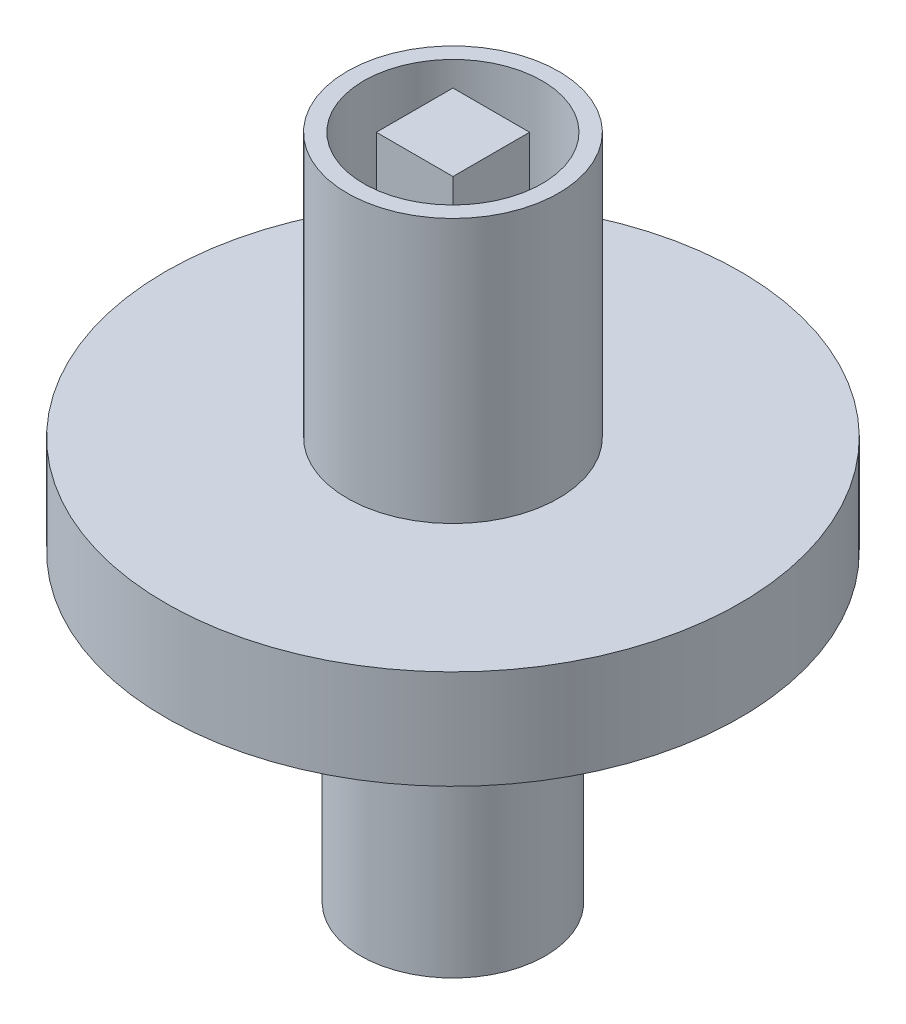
ISO-10303-21;
HEADER;
FILE_DESCRIPTION(('STEP AP214'),'2;1');
FILE_NAME('part.step','',(''),(''),'','','');
FILE_SCHEMA(('AUTOMOTIVE_DESIGN { 1 0 10303 214 1 1 1 1 }'));
ENDSEC;
DATA;
#1=APPLICATION_CONTEXT('core data for automotive mechanical design processes');
#2=APPLICATION_PROTOCOL_DEFINITION('international standard','automotive_design',2000,#1);
#3=PRODUCT_CONTEXT('',#1,'mechanical');
#4=PRODUCT('Part','Part','',(#3));
#5=PRODUCT_RELATED_PRODUCT_CATEGORY('part','',(#4));
#6=PRODUCT_DEFINITION_FORMATION('','',#4);
#7=PRODUCT_DEFINITION_CONTEXT('part definition',#1,'design');
#8=PRODUCT_DEFINITION('design','',#6,#7);
#9=PRODUCT_DEFINITION_SHAPE('','',#8);
#10=(LENGTH_UNIT() NAMED_UNIT(*) SI_UNIT(.MILLI.,.METRE.));
#11=(NAMED_UNIT(*) PLANE_ANGLE_UNIT() SI_UNIT($,.RADIAN.));
#12=(NAMED_UNIT(*) SI_UNIT($,.STERADIAN.) SOLID_ANGLE_UNIT());
#13=UNCERTAINTY_MEASURE_WITH_UNIT(LENGTH_MEASURE(1.E-05),#10,'distance_accuracy_value','');
#14=(GEOMETRIC_REPRESENTATION_CONTEXT(3) GLOBAL_UNCERTAINTY_ASSIGNED_CONTEXT((#13)) GLOBAL_UNIT_ASSIGNED_CONTEXT((#10,
#11,#12)) REPRESENTATION_CONTEXT('',''));
#15=CARTESIAN_POINT('',(0.,0.,0.));
#16=DIRECTION('',(0.,0.,1.));
#17=DIRECTION('',(1.,0.,0.));
#18=AXIS2_PLACEMENT_3D('',#15,#16,#17);
#19=CARTESIAN_POINT('',(0.,-8.,0.));
#20=DIRECTION('',(0.,-1.,0.));
#21=DIRECTION('',(1.,0.,0.));
#22=AXIS2_PLACEMENT_3D('',#19,#20,#21);
#23=CYLINDRICAL_SURFACE('',#22,3.5);
#24=CARTESIAN_POINT('',(0.,-8.,0.));
#25=DIRECTION('',(0.,-1.,0.));
#26=DIRECTION('',(1.,0.,0.));
#27=AXIS2_PLACEMENT_3D('',#24,#25,#26);
#28=CIRCLE('',#27,3.5);
#29=CARTESIAN_POINT('',(-1.49999999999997,-8.00000000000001,3.16227766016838));
#30=VERTEX_POINT('',#29);
#31=CARTESIAN_POINT('',(-3.16227766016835,-8.00000000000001,1.5));
#32=VERTEX_POINT('',#31);
#33=EDGE_CURVE('E199',#30,#32,#28,.T.);
#34=ORIENTED_EDGE('',*,*,#33,.F.);
#35=DIRECTION('',(0.,-1.,0.));
#36=VECTOR('',#35,1.);
#37=CARTESIAN_POINT('',(-1.49999999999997,-8.00000000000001,3.16227766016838));
#38=LINE('',#37,#36);
#39=CARTESIAN_POINT('',(-1.49999999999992,-23.,3.16227766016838));
#40=VERTEX_POINT('',#39);
#41=EDGE_CURVE('E338',#30,#40,#38,.T.);
#42=ORIENTED_EDGE('',*,*,#41,.T.);
#43=CARTESIAN_POINT('',(0.,-23.,0.));
#44=DIRECTION('',(0.,-1.,0.));
#45=DIRECTION('',(1.,0.,0.));
#46=AXIS2_PLACEMENT_3D('',#43,#44,#45);
#47=CIRCLE('',#46,3.5);
#48=CARTESIAN_POINT('',(-3.1622776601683,-23.,1.5));
#49=VERTEX_POINT('',#48);
#50=EDGE_CURVE('E352',#40,#49,#47,.T.);
#51=ORIENTED_EDGE('',*,*,#50,.T.);
#52=DIRECTION('',(0.,-1.,0.));
#53=VECTOR('',#52,1.);
#54=CARTESIAN_POINT('',(-3.16227766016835,-8.00000000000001,1.5));
#55=LINE('',#54,#53);
#56=EDGE_CURVE('E291',#49,#32,#55,.F.);
#57=ORIENTED_EDGE('',*,*,#56,.T.);
#58=EDGE_LOOP('',(#34,#42,#51,#57));
#59=FACE_BOUND('',#58,.T.);
#60=ADVANCED_FACE('F46',(#59),#23,.F.);
#61=CARTESIAN_POINT('',(3.16227766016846,-23.,1.5));
#62=VERTEX_POINT('',#61);
#63=CARTESIAN_POINT('',(1.50000000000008,-23.,3.16227766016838));
#64=VERTEX_POINT('',#63);
#65=EDGE_CURVE('E348',#62,#64,#47,.T.);
#66=ORIENTED_EDGE('',*,*,#65,.T.);
#67=DIRECTION('',(0.,-1.,0.));
#68=VECTOR('',#67,1.);
#69=CARTESIAN_POINT('',(1.50000000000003,-7.99999999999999,3.16227766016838));
#70=LINE('',#69,#68);
#71=CARTESIAN_POINT('',(1.50000000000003,-8.,3.16227766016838));
#72=VERTEX_POINT('',#71);
#73=EDGE_CURVE('E334',#64,#72,#70,.F.);
#74=ORIENTED_EDGE('',*,*,#73,.T.);
#75=CARTESIAN_POINT('',(3.16227766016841,-7.99999999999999,1.5));
#76=VERTEX_POINT('',#75);
#77=EDGE_CURVE('E343',#76,#72,#28,.T.);
#78=ORIENTED_EDGE('',*,*,#77,.F.);
#79=DIRECTION('',(0.,-1.,0.));
#80=VECTOR('',#79,1.);
#81=CARTESIAN_POINT('',(3.16227766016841,-7.99999999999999,1.5));
#82=LINE('',#81,#80);
#83=EDGE_CURVE('E330',#76,#62,#82,.T.);
#84=ORIENTED_EDGE('',*,*,#83,.T.);
#85=EDGE_LOOP('',(#66,#74,#78,#84));
#86=FACE_BOUND('',#85,.T.);
#87=ADVANCED_FACE('F438',(#86),#23,.F.);
#88=CARTESIAN_POINT('',(1.50000000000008,-23.,-3.16227766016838));
#89=VERTEX_POINT('',#88);
#90=CARTESIAN_POINT('',(3.16227766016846,-23.,-1.5));
#91=VERTEX_POINT('',#90);
#92=EDGE_CURVE('E342',#89,#91,#47,.T.);
#93=ORIENTED_EDGE('',*,*,#92,.T.);
#94=DIRECTION('',(0.,-1.,0.));
#95=VECTOR('',#94,1.);
#96=CARTESIAN_POINT('',(3.16227766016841,-7.99999999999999,-1.5));
#97=LINE('',#96,#95);
#98=CARTESIAN_POINT('',(3.16227766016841,-7.99999999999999,-1.5));
#99=VERTEX_POINT('',#98);
#100=EDGE_CURVE('E326',#91,#99,#97,.F.);
#101=ORIENTED_EDGE('',*,*,#100,.T.);
#102=CARTESIAN_POINT('',(1.50000000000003,-7.99999999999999,-3.16227766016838));
#103=VERTEX_POINT('',#102);
#104=EDGE_CURVE('E347',#103,#99,#28,.T.);
#105=ORIENTED_EDGE('',*,*,#104,.F.);
#106=DIRECTION('',(0.,-1.,0.));
#107=VECTOR('',#106,1.);
#108=CARTESIAN_POINT('',(1.50000000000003,-7.99999999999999,-3.16227766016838));
#109=LINE('',#108,#107);
#110=EDGE_CURVE('E322',#103,#89,#109,.T.);
#111=ORIENTED_EDGE('',*,*,#110,.T.);
#112=EDGE_LOOP('',(#93,#101,#105,#111));
#113=FACE_BOUND('',#112,.T.);
#114=ADVANCED_FACE('F433',(#113),#23,.F.);
#115=CARTESIAN_POINT('',(0.,12.5,0.));
#116=DIRECTION('',(0.,1.,0.));
#117=DIRECTION('',(-1.,0.,0.));
#118=AXIS2_PLACEMENT_3D('',#115,#116,#117);
#119=PLANE('',#118);
#120=CARTESIAN_POINT('',(0.,12.5,0.));
#121=DIRECTION('',(0.,1.,0.));
#122=DIRECTION('',(-1.,0.,0.));
#123=AXIS2_PLACEMENT_3D('',#120,#121,#122);
#124=CIRCLE('',#123,6.75);
#125=CARTESIAN_POINT('',(-6.75000000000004,12.5,0.));
#126=VERTEX_POINT('',#125);
#127=EDGE_CURVE('E397',#126,#126,#124,.T.);
#128=ORIENTED_EDGE('',*,*,#127,.T.);
#129=EDGE_LOOP('',(#128));
#130=FACE_BOUND('',#129,.T.);
#131=DIRECTION('',(1.,0.,0.));
#132=VECTOR('',#131,1.);
#133=CARTESIAN_POINT('',(-2.89523813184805,12.5,2.90262546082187));
#134=LINE('',#133,#132);
#135=CARTESIAN_POINT('',(-2.89523813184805,12.5,2.90262546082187));
#136=VERTEX_POINT('',#135);
#137=CARTESIAN_POINT('',(2.90476186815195,12.5,2.90262546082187));
#138=VERTEX_POINT('',#137);
#139=EDGE_CURVE('E375',#136,#138,#134,.T.);
#140=ORIENTED_EDGE('',*,*,#139,.F.);
#141=DIRECTION('',(0.,0.,1.));
#142=VECTOR('',#141,1.);
#143=CARTESIAN_POINT('',(-2.89523813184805,12.5,-2.89737453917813));
#144=LINE('',#143,#142);
#145=CARTESIAN_POINT('',(-2.89523813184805,12.5,-2.89737453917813));
#146=VERTEX_POINT('',#145);
#147=EDGE_CURVE('E355',#146,#136,#144,.T.);
#148=ORIENTED_EDGE('',*,*,#147,.F.);
#149=DIRECTION('',(-1.,0.,0.));
#150=VECTOR('',#149,1.);
#151=CARTESIAN_POINT('',(-2.89523813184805,12.5,-2.89737453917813));
#152=LINE('',#151,#150);
#153=CARTESIAN_POINT('',(2.90476186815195,12.5,-2.89737453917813));
#154=VERTEX_POINT('',#153);
#155=EDGE_CURVE('E362',#154,#146,#152,.T.);
#156=ORIENTED_EDGE('',*,*,#155,.F.);
#157=DIRECTION('',(0.,0.,-1.));
#158=VECTOR('',#157,1.);
#159=CARTESIAN_POINT('',(2.90476186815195,12.5,-2.89737453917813));
#160=LINE('',#159,#158);
#161=EDGE_CURVE('E378',#138,#154,#160,.T.);
#162=ORIENTED_EDGE('',*,*,#161,.F.);
#163=EDGE_LOOP('',(#140,#148,#156,#162));
#164=FACE_BOUND('',#163,.T.);
#165=ADVANCED_FACE('F425',(#130,#164),#119,.T.);
#166=CARTESIAN_POINT('',(0.,0.,0.));
#167=DIRECTION('',(0.,1.,0.));
#168=DIRECTION('',(-1.,0.,0.));
#169=AXIS2_PLACEMENT_3D('',#166,#167,#168);
#170=PLANE('',#169);
#171=CARTESIAN_POINT('',(0.,0.,0.));
#172=DIRECTION('',(0.,-1.,0.));
#173=DIRECTION('',(1.,0.,0.));
#174=AXIS2_PLACEMENT_3D('',#171,#172,#173);
#175=CIRCLE('',#174,7.);
#176=CARTESIAN_POINT('',(7.,0.,0.));
#177=VERTEX_POINT('',#176);
#178=EDGE_CURVE('E11',#177,#177,#175,.T.);
#179=ORIENTED_EDGE('',*,*,#178,.F.);
#180=EDGE_LOOP('',(#179));
#181=FACE_BOUND('',#180,.T.);
#182=CARTESIAN_POINT('',(3.30263446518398E-13,0.,0.));
#183=DIRECTION('',(0.,1.,0.));
#184=DIRECTION('',(-1.,0.,0.));
#185=AXIS2_PLACEMENT_3D('',#182,#183,#184);
#186=CIRCLE('',#185,21.7499999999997);
#187=CARTESIAN_POINT('',(-21.7499999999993,-1.43996854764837E-13,0.));
#188=VERTEX_POINT('',#187);
#189=EDGE_CURVE('E50',#188,#188,#186,.T.);
#190=ORIENTED_EDGE('',*,*,#189,.F.);
#191=EDGE_LOOP('',(#190));
#192=FACE_BOUND('',#191,.T.);
#193=ADVANCED_FACE('F48',(#181,#192),#170,.F.);
#194=CARTESIAN_POINT('',(0.,96.2797297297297,0.));
#195=DIRECTION('',(0.,1.,0.));
#196=DIRECTION('',(-1.,0.,0.));
#197=AXIS2_PLACEMENT_3D('',#194,#195,#196);
#198=CYLINDRICAL_SURFACE('',#197,21.7499999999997);
#199=CARTESIAN_POINT('',(3.04536579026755E-13,7.49999999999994,0.));
#200=DIRECTION('',(0.,1.,0.));
#201=DIRECTION('',(-1.,0.,0.));
#202=AXIS2_PLACEMENT_3D('',#199,#200,#201);
#203=CIRCLE('',#202,21.7499999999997);
#204=CARTESIAN_POINT('',(-21.7499999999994,7.49999999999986,0.));
#205=VERTEX_POINT('',#204);
#206=EDGE_CURVE('E411',#205,#205,#203,.T.);
#207=ORIENTED_EDGE('',*,*,#206,.F.);
#208=EDGE_LOOP('',(#207));
#209=FACE_BOUND('',#208,.T.);
#210=ORIENTED_EDGE('',*,*,#189,.T.);
#211=EDGE_LOOP('',(#210));
#212=FACE_BOUND('',#211,.T.);
#213=ADVANCED_FACE('F422',(#209,#212),#198,.T.);
#214=CARTESIAN_POINT('',(21.75,7.50000000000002,0.));
#215=DIRECTION('',(0.,-1.,0.));
#216=DIRECTION('',(1.,0.,0.));
#217=AXIS2_PLACEMENT_3D('',#214,#215,#216);
#218=PLANE('',#217);
#219=CARTESIAN_POINT('',(3.04536579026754E-13,7.49999999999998,0.));
#220=DIRECTION('',(0.,1.,0.));
#221=DIRECTION('',(-1.,0.,0.));
#222=AXIS2_PLACEMENT_3D('',#219,#220,#221);
#223=CIRCLE('',#222,7.99999999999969);
#224=CARTESIAN_POINT('',(-7.99999999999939,7.49999999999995,0.));
#225=VERTEX_POINT('',#224);
#226=EDGE_CURVE('E408',#225,#225,#223,.T.);
#227=ORIENTED_EDGE('',*,*,#226,.F.);
#228=EDGE_LOOP('',(#227));
#229=FACE_BOUND('',#228,.T.);
#230=ORIENTED_EDGE('',*,*,#206,.T.);
#231=EDGE_LOOP('',(#230));
#232=FACE_BOUND('',#231,.T.);
#233=ADVANCED_FACE('F431',(#229,#232),#218,.F.);
#234=CARTESIAN_POINT('',(0.,96.2797297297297,0.));
#235=DIRECTION('',(0.,1.,0.));
#236=DIRECTION('',(-1.,0.,0.));
#237=AXIS2_PLACEMENT_3D('',#234,#235,#236);
#238=CYLINDRICAL_SURFACE('',#237,7.99999999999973);
#239=CARTESIAN_POINT('',(2.35931599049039E-13,27.5,0.));
#240=DIRECTION('',(0.,1.,0.));
#241=DIRECTION('',(-1.,0.,0.));
#242=AXIS2_PLACEMENT_3D('',#239,#240,#241);
#243=CIRCLE('',#242,7.99999999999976);
#244=CARTESIAN_POINT('',(-7.99999999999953,27.4999999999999,0.));
#245=VERTEX_POINT('',#244);
#246=EDGE_CURVE('E401',#245,#245,#243,.T.);
#247=ORIENTED_EDGE('',*,*,#246,.F.);
#248=EDGE_LOOP('',(#247));
#249=FACE_BOUND('',#248,.T.);
#250=ORIENTED_EDGE('',*,*,#226,.T.);
#251=EDGE_LOOP('',(#250));
#252=FACE_BOUND('',#251,.T.);
#253=ADVANCED_FACE('F763',(#249,#252),#238,.T.);
#254=CARTESIAN_POINT('',(8.,27.5,0.));
#255=DIRECTION('',(0.,-1.,0.));
#256=DIRECTION('',(1.,0.,0.));
#257=AXIS2_PLACEMENT_3D('',#254,#255,#256);
#258=PLANE('',#257);
#259=CARTESIAN_POINT('',(0.,27.5,0.));
#260=DIRECTION('',(0.,1.,0.));
#261=DIRECTION('',(-1.,0.,0.));
#262=AXIS2_PLACEMENT_3D('',#259,#260,#261);
#263=CIRCLE('',#262,6.75);
#264=CARTESIAN_POINT('',(-6.75000000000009,27.5,0.));
#265=VERTEX_POINT('',#264);
#266=EDGE_CURVE('E396',#265,#265,#263,.T.);
#267=ORIENTED_EDGE('',*,*,#266,.F.);
#268=EDGE_LOOP('',(#267));
#269=FACE_BOUND('',#268,.T.);
#270=ORIENTED_EDGE('',*,*,#246,.T.);
#271=EDGE_LOOP('',(#270));
#272=FACE_BOUND('',#271,.T.);
#273=ADVANCED_FACE('F753',(#269,#272),#258,.F.);
#274=CARTESIAN_POINT('',(0.,12.5,0.));
#275=DIRECTION('',(0.,1.,0.));
#276=DIRECTION('',(-1.,0.,0.));
#277=AXIS2_PLACEMENT_3D('',#274,#275,#276);
#278=CYLINDRICAL_SURFACE('',#277,6.75);
#279=ORIENTED_EDGE('',*,*,#127,.F.);
#280=EDGE_LOOP('',(#279));
#281=FACE_BOUND('',#280,.T.);
#282=ORIENTED_EDGE('',*,*,#266,.T.);
#283=EDGE_LOOP('',(#282));
#284=FACE_BOUND('',#283,.T.);
#285=ADVANCED_FACE('F736',(#281,#284),#278,.F.);
#286=CARTESIAN_POINT('',(-2.8952381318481,27.5,-2.89737453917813));
#287=DIRECTION('',(1.,0.,0.));
#288=DIRECTION('',(0.,1.,0.));
#289=AXIS2_PLACEMENT_3D('',#286,#287,#288);
#290=PLANE('',#289);
#291=ORIENTED_EDGE('',*,*,#147,.T.);
#292=DIRECTION('',(0.,-1.,0.));
#293=VECTOR('',#292,1.);
#294=CARTESIAN_POINT('',(-2.8952381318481,27.5,2.90262546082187));
#295=LINE('',#294,#293);
#296=CARTESIAN_POINT('',(-2.8952381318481,27.5,2.90262546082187));
#297=VERTEX_POINT('',#296);
#298=EDGE_CURVE('E393',#297,#136,#295,.T.);
#299=ORIENTED_EDGE('',*,*,#298,.F.);
#300=DIRECTION('',(0.,0.,1.));
#301=VECTOR('',#300,1.);
#302=CARTESIAN_POINT('',(-2.8952381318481,27.5,-2.89737453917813));
#303=LINE('',#302,#301);
#304=CARTESIAN_POINT('',(-2.8952381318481,27.5,-2.89737453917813));
#305=VERTEX_POINT('',#304);
#306=EDGE_CURVE('E357',#305,#297,#303,.T.);
#307=ORIENTED_EDGE('',*,*,#306,.F.);
#308=DIRECTION('',(0.,-1.,0.));
#309=VECTOR('',#308,1.);
#310=CARTESIAN_POINT('',(-2.8952381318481,27.5,-2.89737453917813));
#311=LINE('',#310,#309);
#312=EDGE_CURVE('E371',#305,#146,#311,.T.);
#313=ORIENTED_EDGE('',*,*,#312,.T.);
#314=EDGE_LOOP('',(#291,#299,#307,#313));
#315=FACE_BOUND('',#314,.T.);
#316=ADVANCED_FACE('F726',(#315),#290,.F.);
#317=CARTESIAN_POINT('',(-2.8952381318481,27.5,2.90262546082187));
#318=DIRECTION('',(0.,0.,-1.));
#319=DIRECTION('',(-1.,0.,0.));
#320=AXIS2_PLACEMENT_3D('',#317,#318,#319);
#321=PLANE('',#320);
#322=ORIENTED_EDGE('',*,*,#139,.T.);
#323=DIRECTION('',(0.,-1.,0.));
#324=VECTOR('',#323,1.);
#325=CARTESIAN_POINT('',(2.9047618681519,27.5,2.90262546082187));
#326=LINE('',#325,#324);
#327=CARTESIAN_POINT('',(2.9047618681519,27.5,2.90262546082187));
#328=VERTEX_POINT('',#327);
#329=EDGE_CURVE('E390',#328,#138,#326,.T.);
#330=ORIENTED_EDGE('',*,*,#329,.F.);
#331=DIRECTION('',(1.,0.,0.));
#332=VECTOR('',#331,1.);
#333=CARTESIAN_POINT('',(-2.8952381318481,27.5,2.90262546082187));
#334=LINE('',#333,#332);
#335=EDGE_CURVE('E361',#297,#328,#334,.T.);
#336=ORIENTED_EDGE('',*,*,#335,.F.);
#337=ORIENTED_EDGE('',*,*,#298,.T.);
#338=EDGE_LOOP('',(#322,#330,#336,#337));
#339=FACE_BOUND('',#338,.T.);
#340=ADVANCED_FACE('F716',(#339),#321,.F.);
#341=CARTESIAN_POINT('',(2.9047618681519,27.5,-2.89737453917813));
#342=DIRECTION('',(-1.,0.,0.));
#343=DIRECTION('',(0.,-1.,0.));
#344=AXIS2_PLACEMENT_3D('',#341,#342,#343);
#345=PLANE('',#344);
#346=ORIENTED_EDGE('',*,*,#161,.T.);
#347=DIRECTION('',(0.,-1.,0.));
#348=VECTOR('',#347,1.);
#349=CARTESIAN_POINT('',(2.9047618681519,27.5,-2.89737453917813));
#350=LINE('',#349,#348);
#351=CARTESIAN_POINT('',(2.9047618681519,27.5,-2.89737453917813));
#352=VERTEX_POINT('',#351);
#353=EDGE_CURVE('E387',#352,#154,#350,.T.);
#354=ORIENTED_EDGE('',*,*,#353,.F.);
#355=DIRECTION('',(0.,0.,-1.));
#356=VECTOR('',#355,1.);
#357=CARTESIAN_POINT('',(2.9047618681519,27.5,-2.89737453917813));
#358=LINE('',#357,#356);
#359=EDGE_CURVE('E365',#328,#352,#358,.T.);
#360=ORIENTED_EDGE('',*,*,#359,.F.);
#361=ORIENTED_EDGE('',*,*,#329,.T.);
#362=EDGE_LOOP('',(#346,#354,#360,#361));
#363=FACE_BOUND('',#362,.T.);
#364=ADVANCED_FACE('F704',(#363),#345,.F.);
#365=CARTESIAN_POINT('',(-2.8952381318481,27.5,-2.89737453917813));
#366=DIRECTION('',(0.,0.,1.));
#367=DIRECTION('',(1.,0.,0.));
#368=AXIS2_PLACEMENT_3D('',#365,#366,#367);
#369=PLANE('',#368);
#370=ORIENTED_EDGE('',*,*,#155,.T.);
#371=ORIENTED_EDGE('',*,*,#312,.F.);
#372=DIRECTION('',(-1.,0.,0.));
#373=VECTOR('',#372,1.);
#374=CARTESIAN_POINT('',(-2.8952381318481,27.5,-2.89737453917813));
#375=LINE('',#374,#373);
#376=EDGE_CURVE('E368',#352,#305,#375,.T.);
#377=ORIENTED_EDGE('',*,*,#376,.F.);
#378=ORIENTED_EDGE('',*,*,#353,.T.);
#379=EDGE_LOOP('',(#370,#371,#377,#378));
#380=FACE_BOUND('',#379,.T.);
#381=ADVANCED_FACE('F693',(#380),#369,.F.);
#382=CARTESIAN_POINT('',(0.,27.5,0.));
#383=DIRECTION('',(0.,1.,0.));
#384=DIRECTION('',(-1.,0.,0.));
#385=AXIS2_PLACEMENT_3D('',#382,#383,#384);
#386=PLANE('',#385);
#387=ORIENTED_EDGE('',*,*,#306,.T.);
#388=ORIENTED_EDGE('',*,*,#335,.T.);
#389=ORIENTED_EDGE('',*,*,#359,.T.);
#390=ORIENTED_EDGE('',*,*,#376,.T.);
#391=EDGE_LOOP('',(#387,#388,#389,#390));
#392=FACE_BOUND('',#391,.T.);
#393=ADVANCED_FACE('F676',(#392),#386,.T.);
#394=CARTESIAN_POINT('',(0.,-23.,0.));
#395=DIRECTION('',(0.,1.,0.));
#396=DIRECTION('',(-1.,0.,0.));
#397=AXIS2_PLACEMENT_3D('',#394,#395,#396);
#398=CYLINDRICAL_SURFACE('',#397,7.);
#399=CARTESIAN_POINT('',(0.,-23.,0.));
#400=DIRECTION('',(0.,-1.,0.));
#401=DIRECTION('',(1.,0.,0.));
#402=AXIS2_PLACEMENT_3D('',#399,#400,#401);
#403=CIRCLE('',#402,7.);
#404=CARTESIAN_POINT('',(7.00000000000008,-23.,0.));
#405=VERTEX_POINT('',#404);
#406=EDGE_CURVE('E346',#405,#405,#403,.T.);
#407=ORIENTED_EDGE('',*,*,#406,.F.);
#408=EDGE_LOOP('',(#407));
#409=FACE_BOUND('',#408,.T.);
#410=ORIENTED_EDGE('',*,*,#178,.T.);
#411=EDGE_LOOP('',(#410));
#412=FACE_BOUND('',#411,.T.);
#413=ADVANCED_FACE('F455',(#409,#412),#398,.T.);
#414=CARTESIAN_POINT('',(0.,-23.,0.));
#415=DIRECTION('',(0.,-1.,0.));
#416=DIRECTION('',(1.,0.,0.));
#417=AXIS2_PLACEMENT_3D('',#414,#415,#416);
#418=PLANE('',#417);
#419=DIRECTION('',(0.,0.,-1.));
#420=VECTOR('',#419,1.);
#421=CARTESIAN_POINT('',(-1.49999999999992,-23.,1.5));
#422=LINE('',#421,#420);
#423=CARTESIAN_POINT('',(-1.49999999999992,-23.,5.3));
#424=VERTEX_POINT('',#423);
#425=EDGE_CURVE('E250',#424,#40,#422,.T.);
#426=ORIENTED_EDGE('',*,*,#425,.F.);
#427=DIRECTION('',(-1.,0.,0.));
#428=VECTOR('',#427,1.);
#429=CARTESIAN_POINT('',(-1.49999999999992,-23.,5.3));
#430=LINE('',#429,#428);
#431=CARTESIAN_POINT('',(1.50000000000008,-23.,5.3));
#432=VERTEX_POINT('',#431);
#433=EDGE_CURVE('E284',#432,#424,#430,.T.);
#434=ORIENTED_EDGE('',*,*,#433,.F.);
#435=DIRECTION('',(0.,0.,1.));
#436=VECTOR('',#435,1.);
#437=CARTESIAN_POINT('',(1.50000000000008,-23.,1.5));
#438=LINE('',#437,#436);
#439=EDGE_CURVE('E281',#64,#432,#438,.T.);
#440=ORIENTED_EDGE('',*,*,#439,.F.);
#441=ORIENTED_EDGE('',*,*,#65,.F.);
#442=DIRECTION('',(-1.,0.,0.));
#443=VECTOR('',#442,1.);
#444=CARTESIAN_POINT('',(1.50000000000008,-23.,1.5));
#445=LINE('',#444,#443);
#446=CARTESIAN_POINT('',(5.30000000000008,-23.,1.5));
#447=VERTEX_POINT('',#446);
#448=EDGE_CURVE('E278',#447,#62,#445,.T.);
#449=ORIENTED_EDGE('',*,*,#448,.F.);
#450=DIRECTION('',(0.,0.,1.));
#451=VECTOR('',#450,1.);
#452=CARTESIAN_POINT('',(5.30000000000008,-23.,1.5));
#453=LINE('',#452,#451);
#454=CARTESIAN_POINT('',(5.30000000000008,-23.,-1.5));
#455=VERTEX_POINT('',#454);
#456=EDGE_CURVE('E274',#455,#447,#453,.T.);
#457=ORIENTED_EDGE('',*,*,#456,.F.);
#458=DIRECTION('',(1.,0.,0.));
#459=VECTOR('',#458,1.);
#460=CARTESIAN_POINT('',(1.50000000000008,-23.,-1.5));
#461=LINE('',#460,#459);
#462=EDGE_CURVE('E271',#91,#455,#461,.T.);
#463=ORIENTED_EDGE('',*,*,#462,.F.);
#464=ORIENTED_EDGE('',*,*,#92,.F.);
#465=DIRECTION('',(0.,0.,1.));
#466=VECTOR('',#465,1.);
#467=CARTESIAN_POINT('',(1.50000000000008,-23.,-5.3));
#468=LINE('',#467,#466);
#469=CARTESIAN_POINT('',(1.50000000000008,-23.,-5.3));
#470=VERTEX_POINT('',#469);
#471=EDGE_CURVE('E268',#470,#89,#468,.T.);
#472=ORIENTED_EDGE('',*,*,#471,.F.);
#473=DIRECTION('',(1.,0.,0.));
#474=VECTOR('',#473,1.);
#475=CARTESIAN_POINT('',(-1.49999999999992,-23.,-5.3));
#476=LINE('',#475,#474);
#477=CARTESIAN_POINT('',(-1.49999999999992,-23.,-5.3));
#478=VERTEX_POINT('',#477);
#479=EDGE_CURVE('E264',#478,#470,#476,.T.);
#480=ORIENTED_EDGE('',*,*,#479,.F.);
#481=DIRECTION('',(0.,0.,-1.));
#482=VECTOR('',#481,1.);
#483=CARTESIAN_POINT('',(-1.49999999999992,-23.,-5.3));
#484=LINE('',#483,#482);
#485=CARTESIAN_POINT('',(-1.49999999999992,-23.,-3.16227766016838));
#486=VERTEX_POINT('',#485);
#487=EDGE_CURVE('E261',#486,#478,#484,.T.);
#488=ORIENTED_EDGE('',*,*,#487,.F.);
#489=CARTESIAN_POINT('',(-3.1622776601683,-23.,-1.5));
#490=VERTEX_POINT('',#489);
#491=EDGE_CURVE('E468',#490,#486,#47,.T.);
#492=ORIENTED_EDGE('',*,*,#491,.F.);
#493=DIRECTION('',(1.,0.,0.));
#494=VECTOR('',#493,1.);
#495=CARTESIAN_POINT('',(-5.29999999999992,-23.,-1.5));
#496=LINE('',#495,#494);
#497=CARTESIAN_POINT('',(-5.29999999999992,-23.,-1.5));
#498=VERTEX_POINT('',#497);
#499=EDGE_CURVE('E258',#498,#490,#496,.T.);
#500=ORIENTED_EDGE('',*,*,#499,.F.);
#501=DIRECTION('',(0.,0.,-1.));
#502=VECTOR('',#501,1.);
#503=CARTESIAN_POINT('',(-5.29999999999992,-23.,1.5));
#504=LINE('',#503,#502);
#505=CARTESIAN_POINT('',(-5.29999999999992,-23.,1.5));
#506=VERTEX_POINT('',#505);
#507=EDGE_CURVE('E255',#506,#498,#504,.T.);
#508=ORIENTED_EDGE('',*,*,#507,.F.);
#509=DIRECTION('',(-1.,0.,0.));
#510=VECTOR('',#509,1.);
#511=CARTESIAN_POINT('',(-5.29999999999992,-23.,1.5));
#512=LINE('',#511,#510);
#513=EDGE_CURVE('E209',#49,#506,#512,.T.);
#514=ORIENTED_EDGE('',*,*,#513,.F.);
#515=ORIENTED_EDGE('',*,*,#50,.F.);
#516=EDGE_LOOP('',(#426,#434,#440,#441,#449,#457,#463,#464,#472,#480,#488,#492,#500,#508,#514,#515));
#517=FACE_BOUND('',#516,.T.);
#518=ORIENTED_EDGE('',*,*,#406,.T.);
#519=EDGE_LOOP('',(#518));
#520=FACE_BOUND('',#519,.T.);
#521=ADVANCED_FACE('F449',(#517,#520),#418,.T.);
#522=ORIENTED_EDGE('',*,*,#491,.T.);
#523=DIRECTION('',(0.,-1.,0.));
#524=VECTOR('',#523,1.);
#525=CARTESIAN_POINT('',(-1.49999999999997,-8.00000000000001,-3.16227766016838));
#526=LINE('',#525,#524);
#527=CARTESIAN_POINT('',(-1.49999999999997,-8.,-3.16227766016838));
#528=VERTEX_POINT('',#527);
#529=EDGE_CURVE('E318',#486,#528,#526,.F.);
#530=ORIENTED_EDGE('',*,*,#529,.T.);
#531=CARTESIAN_POINT('',(-3.16227766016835,-8.00000000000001,-1.5));
#532=VERTEX_POINT('',#531);
#533=EDGE_CURVE('E487',#532,#528,#28,.T.);
#534=ORIENTED_EDGE('',*,*,#533,.F.);
#535=DIRECTION('',(0.,-1.,0.));
#536=VECTOR('',#535,1.);
#537=CARTESIAN_POINT('',(-3.16227766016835,-8.00000000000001,-1.5));
#538=LINE('',#537,#536);
#539=EDGE_CURVE('E314',#532,#490,#538,.T.);
#540=ORIENTED_EDGE('',*,*,#539,.T.);
#541=EDGE_LOOP('',(#522,#530,#534,#540));
#542=FACE_BOUND('',#541,.T.);
#543=ADVANCED_FACE('F441',(#542),#23,.F.);
#544=CARTESIAN_POINT('',(0.,-8.,0.));
#545=DIRECTION('',(0.,-1.,0.));
#546=DIRECTION('',(1.,0.,0.));
#547=AXIS2_PLACEMENT_3D('',#544,#545,#546);
#548=PLANE('',#547);
#549=ORIENTED_EDGE('',*,*,#77,.T.);
#550=DIRECTION('',(0.,0.,1.));
#551=VECTOR('',#550,1.);
#552=CARTESIAN_POINT('',(1.50000000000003,-8.,1.5));
#553=LINE('',#552,#551);
#554=CARTESIAN_POINT('',(1.50000000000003,-8.,5.3));
#555=VERTEX_POINT('',#554);
#556=EDGE_CURVE('E244',#72,#555,#553,.T.);
#557=ORIENTED_EDGE('',*,*,#556,.T.);
#558=DIRECTION('',(-1.,0.,0.));
#559=VECTOR('',#558,1.);
#560=CARTESIAN_POINT('',(-1.49999999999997,-8.,5.3));
#561=LINE('',#560,#559);
#562=CARTESIAN_POINT('',(-1.49999999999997,-8.,5.3));
#563=VERTEX_POINT('',#562);
#564=EDGE_CURVE('E215',#555,#563,#561,.T.);
#565=ORIENTED_EDGE('',*,*,#564,.T.);
#566=DIRECTION('',(0.,0.,-1.));
#567=VECTOR('',#566,1.);
#568=CARTESIAN_POINT('',(-1.49999999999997,-8.,1.5));
#569=LINE('',#568,#567);
#570=EDGE_CURVE('E203',#563,#30,#569,.T.);
#571=ORIENTED_EDGE('',*,*,#570,.T.);
#572=ORIENTED_EDGE('',*,*,#33,.T.);
#573=DIRECTION('',(-1.,0.,0.));
#574=VECTOR('',#573,1.);
#575=CARTESIAN_POINT('',(-5.29999999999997,-8.00000000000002,1.5));
#576=LINE('',#575,#574);
#577=CARTESIAN_POINT('',(-5.29999999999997,-8.00000000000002,1.5));
#578=VERTEX_POINT('',#577);
#579=EDGE_CURVE('E192',#32,#578,#576,.T.);
#580=ORIENTED_EDGE('',*,*,#579,.T.);
#581=DIRECTION('',(0.,0.,-1.));
#582=VECTOR('',#581,1.);
#583=CARTESIAN_POINT('',(-5.29999999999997,-8.00000000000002,1.5));
#584=LINE('',#583,#582);
#585=CARTESIAN_POINT('',(-5.29999999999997,-8.00000000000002,-1.5));
#586=VERTEX_POINT('',#585);
#587=EDGE_CURVE('E197',#578,#586,#584,.T.);
#588=ORIENTED_EDGE('',*,*,#587,.T.);
#589=DIRECTION('',(1.,0.,0.));
#590=VECTOR('',#589,1.);
#591=CARTESIAN_POINT('',(-5.29999999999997,-8.00000000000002,-1.5));
#592=LINE('',#591,#590);
#593=EDGE_CURVE('E70',#586,#532,#592,.T.);
#594=ORIENTED_EDGE('',*,*,#593,.T.);
#595=ORIENTED_EDGE('',*,*,#533,.T.);
#596=DIRECTION('',(0.,0.,-1.));
#597=VECTOR('',#596,1.);
#598=CARTESIAN_POINT('',(-1.49999999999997,-8.,-5.3));
#599=LINE('',#598,#597);
#600=CARTESIAN_POINT('',(-1.49999999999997,-8.,-5.3));
#601=VERTEX_POINT('',#600);
#602=EDGE_CURVE('E224',#528,#601,#599,.T.);
#603=ORIENTED_EDGE('',*,*,#602,.T.);
#604=DIRECTION('',(1.,0.,0.));
#605=VECTOR('',#604,1.);
#606=CARTESIAN_POINT('',(-1.49999999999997,-8.,-5.3));
#607=LINE('',#606,#605);
#608=CARTESIAN_POINT('',(1.50000000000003,-8.,-5.3));
#609=VERTEX_POINT('',#608);
#610=EDGE_CURVE('E229',#601,#609,#607,.T.);
#611=ORIENTED_EDGE('',*,*,#610,.T.);
#612=DIRECTION('',(0.,0.,1.));
#613=VECTOR('',#612,1.);
#614=CARTESIAN_POINT('',(1.50000000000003,-8.,-5.3));
#615=LINE('',#614,#613);
#616=EDGE_CURVE('E63',#609,#103,#615,.T.);
#617=ORIENTED_EDGE('',*,*,#616,.T.);
#618=ORIENTED_EDGE('',*,*,#104,.T.);
#619=DIRECTION('',(1.,0.,0.));
#620=VECTOR('',#619,1.);
#621=CARTESIAN_POINT('',(1.50000000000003,-8.,-1.5));
#622=LINE('',#621,#620);
#623=CARTESIAN_POINT('',(5.30000000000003,-7.99999999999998,-1.5));
#624=VERTEX_POINT('',#623);
#625=EDGE_CURVE('E234',#99,#624,#622,.T.);
#626=ORIENTED_EDGE('',*,*,#625,.T.);
#627=DIRECTION('',(0.,0.,1.));
#628=VECTOR('',#627,1.);
#629=CARTESIAN_POINT('',(5.30000000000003,-7.99999999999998,1.5));
#630=LINE('',#629,#628);
#631=CARTESIAN_POINT('',(5.30000000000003,-7.99999999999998,1.5));
#632=VERTEX_POINT('',#631);
#633=EDGE_CURVE('E237',#624,#632,#630,.T.);
#634=ORIENTED_EDGE('',*,*,#633,.T.);
#635=DIRECTION('',(-1.,0.,0.));
#636=VECTOR('',#635,1.);
#637=CARTESIAN_POINT('',(1.50000000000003,-8.,1.5));
#638=LINE('',#637,#636);
#639=EDGE_CURVE('E241',#632,#76,#638,.T.);
#640=ORIENTED_EDGE('',*,*,#639,.T.);
#641=EDGE_LOOP('',(#549,#557,#565,#571,#572,#580,#588,#594,#595,#603,#611,#617,#618,#626,#634,#640));
#642=FACE_BOUND('',#641,.T.);
#643=ADVANCED_FACE('F195',(#642),#548,.T.);
#644=CARTESIAN_POINT('',(-5.29999999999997,-8.00000000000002,1.5));
#645=DIRECTION('',(0.,0.,1.));
#646=DIRECTION('',(1.,0.,0.));
#647=AXIS2_PLACEMENT_3D('',#644,#645,#646);
#648=PLANE('',#647);
#649=ORIENTED_EDGE('',*,*,#513,.T.);
#650=DIRECTION('',(0.,-1.,0.));
#651=VECTOR('',#650,1.);
#652=CARTESIAN_POINT('',(-5.29999999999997,-8.00000000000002,1.5));
#653=LINE('',#652,#651);
#654=EDGE_CURVE('E206',#578,#506,#653,.T.);
#655=ORIENTED_EDGE('',*,*,#654,.F.);
#656=ORIENTED_EDGE('',*,*,#579,.F.);
#657=ORIENTED_EDGE('',*,*,#56,.F.);
#658=EDGE_LOOP('',(#649,#655,#656,#657));
#659=FACE_BOUND('',#658,.T.);
#660=ADVANCED_FACE('F207',(#659),#648,.F.);
#661=CARTESIAN_POINT('',(-5.29999999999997,-8.00000000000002,-1.5));
#662=DIRECTION('',(0.,0.,-1.));
#663=DIRECTION('',(-1.,0.,0.));
#664=AXIS2_PLACEMENT_3D('',#661,#662,#663);
#665=PLANE('',#664);
#666=ORIENTED_EDGE('',*,*,#593,.F.);
#667=DIRECTION('',(0.,-1.,0.));
#668=VECTOR('',#667,1.);
#669=CARTESIAN_POINT('',(-5.29999999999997,-8.00000000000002,-1.5));
#670=LINE('',#669,#668);
#671=EDGE_CURVE('E214',#586,#498,#670,.T.);
#672=ORIENTED_EDGE('',*,*,#671,.T.);
#673=ORIENTED_EDGE('',*,*,#499,.T.);
#674=ORIENTED_EDGE('',*,*,#539,.F.);
#675=EDGE_LOOP('',(#666,#672,#673,#674));
#676=FACE_BOUND('',#675,.T.);
#677=ADVANCED_FACE('F485',(#676),#665,.F.);
#678=CARTESIAN_POINT('',(-5.29999999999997,-8.00000000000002,1.5));
#679=DIRECTION('',(-1.,0.,0.));
#680=DIRECTION('',(0.,-1.,0.));
#681=AXIS2_PLACEMENT_3D('',#678,#679,#680);
#682=PLANE('',#681);
#683=ORIENTED_EDGE('',*,*,#507,.T.);
#684=ORIENTED_EDGE('',*,*,#671,.F.);
#685=ORIENTED_EDGE('',*,*,#587,.F.);
#686=ORIENTED_EDGE('',*,*,#654,.T.);
#687=EDGE_LOOP('',(#683,#684,#685,#686));
#688=FACE_BOUND('',#687,.T.);
#689=ADVANCED_FACE('F217',(#688),#682,.F.);
#690=CARTESIAN_POINT('',(1.50000000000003,-8.,1.5));
#691=DIRECTION('',(1.,0.,0.));
#692=DIRECTION('',(0.,1.,0.));
#693=AXIS2_PLACEMENT_3D('',#690,#691,#692);
#694=PLANE('',#693);
#695=ORIENTED_EDGE('',*,*,#439,.T.);
#696=DIRECTION('',(0.,-1.,0.));
#697=VECTOR('',#696,1.);
#698=CARTESIAN_POINT('',(1.50000000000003,-8.,5.3));
#699=LINE('',#698,#697);
#700=EDGE_CURVE('E292',#555,#432,#699,.T.);
#701=ORIENTED_EDGE('',*,*,#700,.F.);
#702=ORIENTED_EDGE('',*,*,#556,.F.);
#703=ORIENTED_EDGE('',*,*,#73,.F.);
#704=EDGE_LOOP('',(#695,#701,#702,#703));
#705=FACE_BOUND('',#704,.T.);
#706=ADVANCED_FACE('F509',(#705),#694,.F.);
#707=CARTESIAN_POINT('',(-1.49999999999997,-8.,1.5));
#708=DIRECTION('',(-1.,0.,0.));
#709=DIRECTION('',(0.,-1.,0.));
#710=AXIS2_PLACEMENT_3D('',#707,#708,#709);
#711=PLANE('',#710);
#712=ORIENTED_EDGE('',*,*,#570,.F.);
#713=DIRECTION('',(0.,-1.,0.));
#714=VECTOR('',#713,1.);
#715=CARTESIAN_POINT('',(-1.49999999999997,-8.,5.3));
#716=LINE('',#715,#714);
#717=EDGE_CURVE('E288',#563,#424,#716,.T.);
#718=ORIENTED_EDGE('',*,*,#717,.T.);
#719=ORIENTED_EDGE('',*,*,#425,.T.);
#720=ORIENTED_EDGE('',*,*,#41,.F.);
#721=EDGE_LOOP('',(#712,#718,#719,#720));
#722=FACE_BOUND('',#721,.T.);
#723=ADVANCED_FACE('F516',(#722),#711,.F.);
#724=CARTESIAN_POINT('',(-1.49999999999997,-8.,5.3));
#725=DIRECTION('',(0.,0.,1.));
#726=DIRECTION('',(1.,0.,0.));
#727=AXIS2_PLACEMENT_3D('',#724,#725,#726);
#728=PLANE('',#727);
#729=ORIENTED_EDGE('',*,*,#433,.T.);
#730=ORIENTED_EDGE('',*,*,#717,.F.);
#731=ORIENTED_EDGE('',*,*,#564,.F.);
#732=ORIENTED_EDGE('',*,*,#700,.T.);
#733=EDGE_LOOP('',(#729,#730,#731,#732));
#734=FACE_BOUND('',#733,.T.);
#735=ADVANCED_FACE('F511',(#734),#728,.F.);
#736=CARTESIAN_POINT('',(1.50000000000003,-8.,-1.5));
#737=DIRECTION('',(0.,0.,-1.));
#738=DIRECTION('',(-1.,0.,0.));
#739=AXIS2_PLACEMENT_3D('',#736,#737,#738);
#740=PLANE('',#739);
#741=ORIENTED_EDGE('',*,*,#462,.T.);
#742=DIRECTION('',(0.,-1.,0.));
#743=VECTOR('',#742,1.);
#744=CARTESIAN_POINT('',(5.30000000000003,-7.99999999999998,-1.5));
#745=LINE('',#744,#743);
#746=EDGE_CURVE('E299',#624,#455,#745,.T.);
#747=ORIENTED_EDGE('',*,*,#746,.F.);
#748=ORIENTED_EDGE('',*,*,#625,.F.);
#749=ORIENTED_EDGE('',*,*,#100,.F.);
#750=EDGE_LOOP('',(#741,#747,#748,#749));
#751=FACE_BOUND('',#750,.T.);
#752=ADVANCED_FACE('F495',(#751),#740,.F.);
#753=CARTESIAN_POINT('',(1.50000000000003,-8.,1.5));
#754=DIRECTION('',(0.,0.,1.));
#755=DIRECTION('',(1.,0.,0.));
#756=AXIS2_PLACEMENT_3D('',#753,#754,#755);
#757=PLANE('',#756);
#758=ORIENTED_EDGE('',*,*,#639,.F.);
#759=DIRECTION('',(0.,-1.,0.));
#760=VECTOR('',#759,1.);
#761=CARTESIAN_POINT('',(5.30000000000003,-7.99999999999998,1.5));
#762=LINE('',#761,#760);
#763=EDGE_CURVE('E296',#632,#447,#762,.T.);
#764=ORIENTED_EDGE('',*,*,#763,.T.);
#765=ORIENTED_EDGE('',*,*,#448,.T.);
#766=ORIENTED_EDGE('',*,*,#83,.F.);
#767=EDGE_LOOP('',(#758,#764,#765,#766));
#768=FACE_BOUND('',#767,.T.);
#769=ADVANCED_FACE('F503',(#768),#757,.F.);
#770=CARTESIAN_POINT('',(5.30000000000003,-7.99999999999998,1.5));
#771=DIRECTION('',(1.,0.,0.));
#772=DIRECTION('',(0.,1.,0.));
#773=AXIS2_PLACEMENT_3D('',#770,#771,#772);
#774=PLANE('',#773);
#775=ORIENTED_EDGE('',*,*,#456,.T.);
#776=ORIENTED_EDGE('',*,*,#763,.F.);
#777=ORIENTED_EDGE('',*,*,#633,.F.);
#778=ORIENTED_EDGE('',*,*,#746,.T.);
#779=EDGE_LOOP('',(#775,#776,#777,#778));
#780=FACE_BOUND('',#779,.T.);
#781=ADVANCED_FACE('F498',(#780),#774,.F.);
#782=CARTESIAN_POINT('',(1.50000000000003,-8.,-5.3));
#783=DIRECTION('',(1.,0.,0.));
#784=DIRECTION('',(0.,1.,0.));
#785=AXIS2_PLACEMENT_3D('',#782,#783,#784);
#786=PLANE('',#785);
#787=ORIENTED_EDGE('',*,*,#616,.F.);
#788=DIRECTION('',(0.,-1.,0.));
#789=VECTOR('',#788,1.);
#790=CARTESIAN_POINT('',(1.50000000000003,-8.,-5.3));
#791=LINE('',#790,#789);
#792=EDGE_CURVE('E303',#609,#470,#791,.T.);
#793=ORIENTED_EDGE('',*,*,#792,.T.);
#794=ORIENTED_EDGE('',*,*,#471,.T.);
#795=ORIENTED_EDGE('',*,*,#110,.F.);
#796=EDGE_LOOP('',(#787,#793,#794,#795));
#797=FACE_BOUND('',#796,.T.);
#798=ADVANCED_FACE('F536',(#797),#786,.F.);
#799=CARTESIAN_POINT('',(-1.49999999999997,-8.,-5.3));
#800=DIRECTION('',(-1.,0.,0.));
#801=DIRECTION('',(0.,-1.,0.));
#802=AXIS2_PLACEMENT_3D('',#799,#800,#801);
#803=PLANE('',#802);
#804=ORIENTED_EDGE('',*,*,#487,.T.);
#805=DIRECTION('',(0.,-1.,0.));
#806=VECTOR('',#805,1.);
#807=CARTESIAN_POINT('',(-1.49999999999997,-8.,-5.3));
#808=LINE('',#807,#806);
#809=EDGE_CURVE('E306',#601,#478,#808,.T.);
#810=ORIENTED_EDGE('',*,*,#809,.F.);
#811=ORIENTED_EDGE('',*,*,#602,.F.);
#812=ORIENTED_EDGE('',*,*,#529,.F.);
#813=EDGE_LOOP('',(#804,#810,#811,#812));
#814=FACE_BOUND('',#813,.T.);
#815=ADVANCED_FACE('F532',(#814),#803,.F.);
#816=CARTESIAN_POINT('',(-1.49999999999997,-8.,-5.3));
#817=DIRECTION('',(0.,0.,-1.));
#818=DIRECTION('',(-1.,0.,0.));
#819=AXIS2_PLACEMENT_3D('',#816,#817,#818);
#820=PLANE('',#819);
#821=ORIENTED_EDGE('',*,*,#479,.T.);
#822=ORIENTED_EDGE('',*,*,#792,.F.);
#823=ORIENTED_EDGE('',*,*,#610,.F.);
#824=ORIENTED_EDGE('',*,*,#809,.T.);
#825=EDGE_LOOP('',(#821,#822,#823,#824));
#826=FACE_BOUND('',#825,.T.);
#827=ADVANCED_FACE('F535',(#826),#820,.F.);
#828=CLOSED_SHELL('',(#60,#87,#114,#165,#193,#213,#233,#253,#273,#285,#316,#340,#364,#381,#393,
#413,#521,#543,#643,#660,#677,#689,#706,#723,#735,#752,#769,#781,#798,#815,#827));
#829=MANIFOLD_SOLID_BREP('B2',#828);
#830=ADVANCED_BREP_SHAPE_REPRESENTATION('',(#18,#829),#14);
#831=SHAPE_DEFINITION_REPRESENTATION(#9,#830);
ENDSEC;
END-ISO-10303-21;
